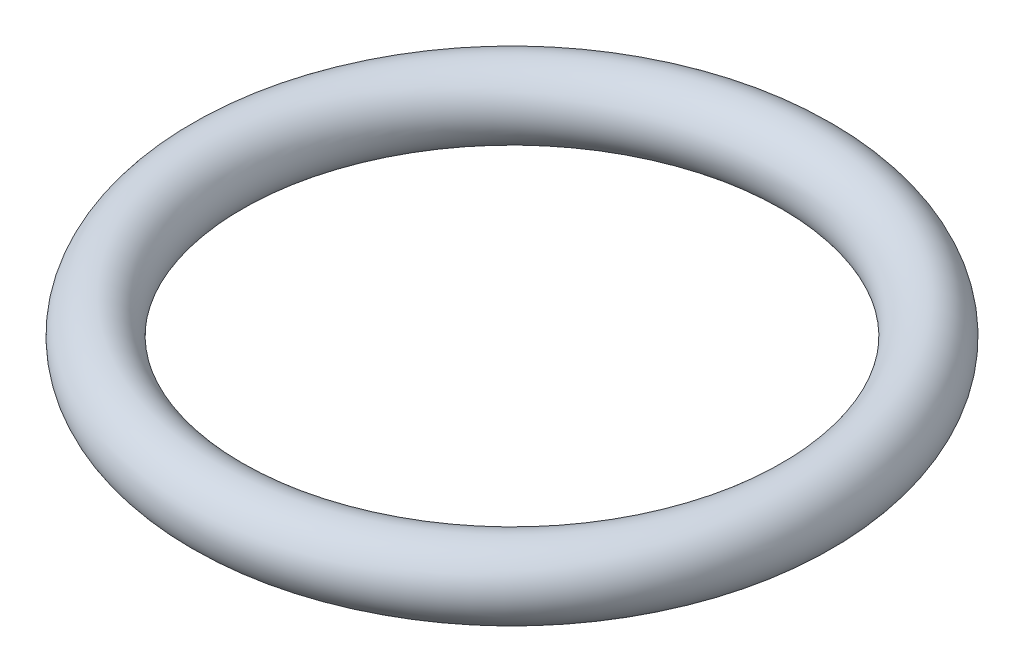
ISO-10303-21;
HEADER;
FILE_DESCRIPTION(('STEP AP214'),'2;1');
FILE_NAME('part.step','',(''),(''),'','','');
FILE_SCHEMA(('AUTOMOTIVE_DESIGN { 1 0 10303 214 1 1 1 1 }'));
ENDSEC;
DATA;
#1=APPLICATION_CONTEXT('core data for automotive mechanical design processes');
#2=APPLICATION_PROTOCOL_DEFINITION('international standard','automotive_design',2000,#1);
#3=PRODUCT_CONTEXT('',#1,'mechanical');
#4=PRODUCT('Part','Part','',(#3));
#5=PRODUCT_RELATED_PRODUCT_CATEGORY('part','',(#4));
#6=PRODUCT_DEFINITION_FORMATION('','',#4);
#7=PRODUCT_DEFINITION_CONTEXT('part definition',#1,'design');
#8=PRODUCT_DEFINITION('design','',#6,#7);
#9=PRODUCT_DEFINITION_SHAPE('','',#8);
#10=(LENGTH_UNIT() NAMED_UNIT(*) SI_UNIT(.MILLI.,.METRE.));
#11=(NAMED_UNIT(*) PLANE_ANGLE_UNIT() SI_UNIT($,.RADIAN.));
#12=(NAMED_UNIT(*) SI_UNIT($,.STERADIAN.) SOLID_ANGLE_UNIT());
#13=UNCERTAINTY_MEASURE_WITH_UNIT(LENGTH_MEASURE(1.E-05),#10,'distance_accuracy_value','');
#14=(GEOMETRIC_REPRESENTATION_CONTEXT(3) GLOBAL_UNCERTAINTY_ASSIGNED_CONTEXT((#13)) GLOBAL_UNIT_ASSIGNED_CONTEXT((#10,
#11,#12)) REPRESENTATION_CONTEXT('',''));
#15=CARTESIAN_POINT('',(0.,0.,0.));
#16=DIRECTION('',(0.,0.,1.));
#17=DIRECTION('',(1.,0.,0.));
#18=AXIS2_PLACEMENT_3D('',#15,#16,#17);
#19=CARTESIAN_POINT('',(0.,0.,0.));
#20=DIRECTION('',(0.,-1.,0.));
#21=DIRECTION('',(0.,0.,-1.));
#22=AXIS2_PLACEMENT_3D('',#19,#20,#21);
#23=TOROIDAL_SURFACE('',#22,14.7,1.74999999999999);
#24=CARTESIAN_POINT('',(0.,0.,-16.45));
#25=VERTEX_POINT('',#24);
#26=VERTEX_LOOP('',#25);
#27=FACE_BOUND('',#26,.T.);
#28=ADVANCED_FACE('F28',(#27),#23,.T.);
#29=CLOSED_SHELL('',(#28));
#30=MANIFOLD_SOLID_BREP('B2',#29);
#31=ADVANCED_BREP_SHAPE_REPRESENTATION('',(#18,#30),#14);
#32=SHAPE_DEFINITION_REPRESENTATION(#9,#31);
ENDSEC;
END-ISO-10303-21;
